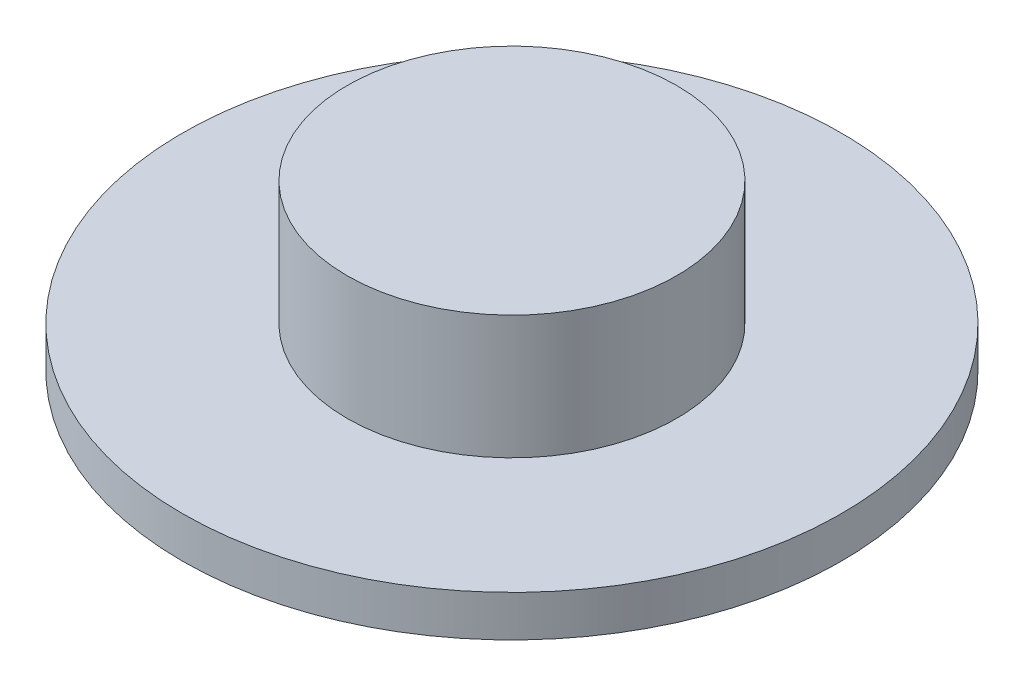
from build123d import *

# Parameters (mm, degrees)
SKETCH1_R           = 80
BOSS_EXTRUDE1_DEPTH = 10
SKETCH2_R           = 40
BOSS_EXTRUDE2_DEPTH = 40


with BuildPart() as part:
    # Sketch1 → Boss-Extrude1 (new body)
    with BuildSketch(Plane(origin=(0, 0, 0), x_dir=(1, 0, 0), z_dir=(0, 1, 0))):
        with Locations(Location((0, 0, 0), (0, 0, 270))):
            Circle(SKETCH1_R)
    extrude(amount=BOSS_EXTRUDE1_DEPTH)

    # Sketch2 → Boss-Extrude2 (add)
    with BuildSketch(Plane(origin=(0, 0, 0), x_dir=(1, 0, 0), z_dir=(0, 1, 0))):
        with Locations(Location((0, 0, 0), (0, 0, 270))):
            Circle(SKETCH2_R)
    extrude(amount=BOSS_EXTRUDE2_DEPTH)


solid = part.part
